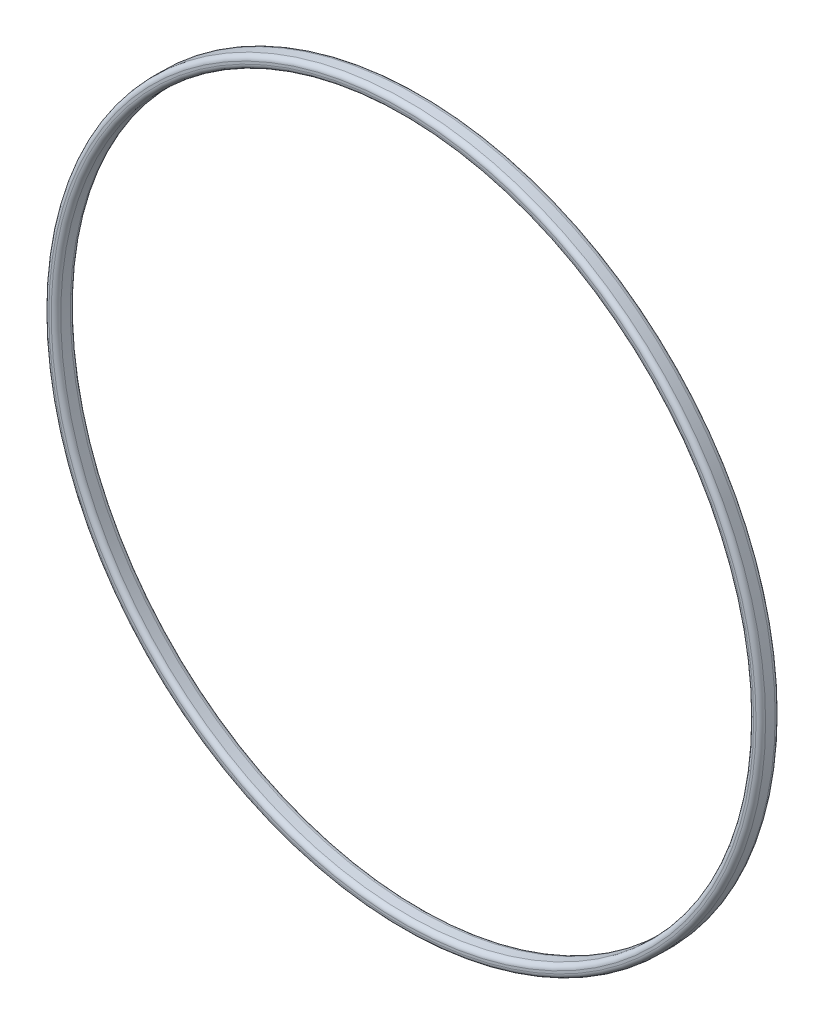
from build123d import *


with BuildPart() as part:
    # Esquisse1 → R_volution1 (revolve)
    with BuildSketch(Plane(origin=(0, 0, 0), x_dir=(0, 0, -1), z_dir=(1, 0, 0)), mode=Mode.PRIVATE) as r_volution1_sk:
        with BuildLine():
            Line((1.459361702, 75), (3.459361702, 75))
            ThreePointArc((3.459361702, 75), (4.166468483, 74.707106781), (4.459361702, 74))
            Line((4.459361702, 74), (4.459361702, 73.5))
            ThreePointArc((4.459361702, 73.5), (4.166468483, 72.792893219), (3.459361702, 72.5))
            Line((3.459361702, 72.5), (1.459361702, 72.5))
            ThreePointArc((1.459361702, 72.5), (0.752254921, 72.792893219), (0.459361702, 73.5))
            Line((0.459361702, 73.5), (0.459361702, 74))
            ThreePointArc((0.459361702, 74), (0.752254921, 74.707106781), (1.459361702, 75))
        make_face()
    revolve(r_volution1_sk.sketch.rotate(Axis((0, 0, 20.824397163), (0, 0, -1)), 90), axis=Axis((0, 0, 20.824397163), (0, 0, -1)))


solid = part.part
